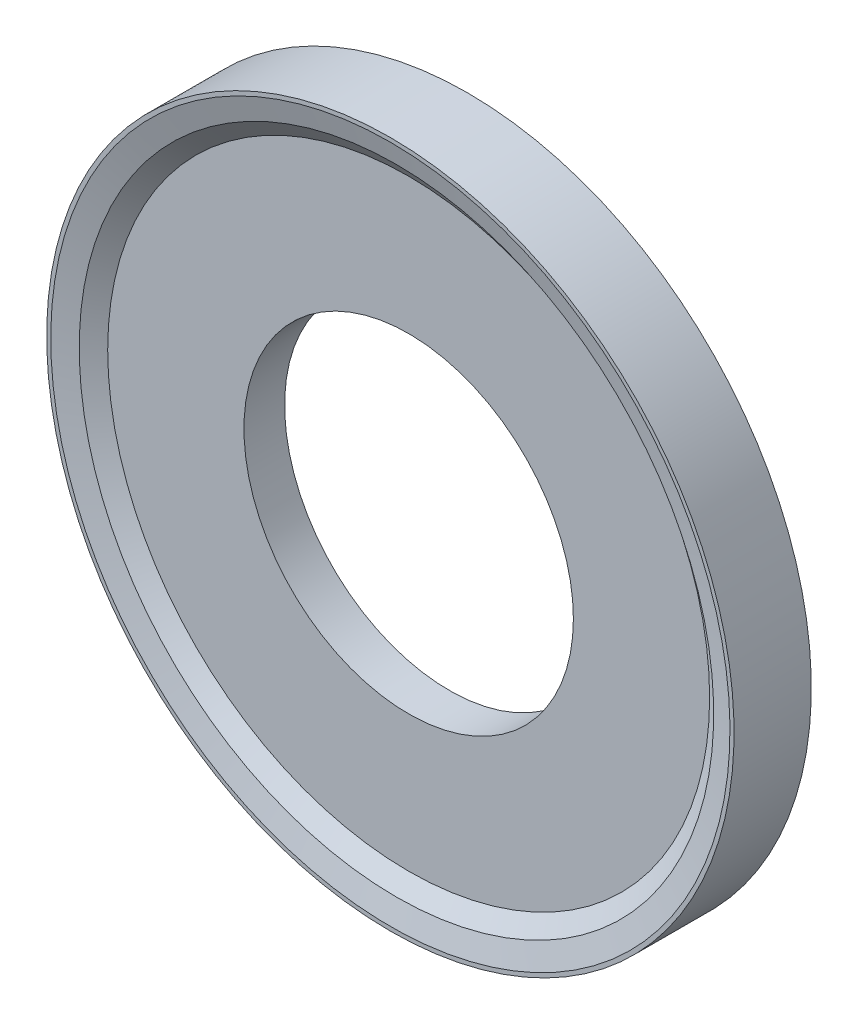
ISO-10303-21;
HEADER;
FILE_DESCRIPTION(('STEP AP214'),'2;1');
FILE_NAME('part.step','',(''),(''),'','','');
FILE_SCHEMA(('AUTOMOTIVE_DESIGN { 1 0 10303 214 1 1 1 1 }'));
ENDSEC;
DATA;
#1=APPLICATION_CONTEXT('core data for automotive mechanical design processes');
#2=APPLICATION_PROTOCOL_DEFINITION('international standard','automotive_design',2000,#1);
#3=PRODUCT_CONTEXT('',#1,'mechanical');
#4=PRODUCT('Part','Part','',(#3));
#5=PRODUCT_RELATED_PRODUCT_CATEGORY('part','',(#4));
#6=PRODUCT_DEFINITION_FORMATION('','',#4);
#7=PRODUCT_DEFINITION_CONTEXT('part definition',#1,'design');
#8=PRODUCT_DEFINITION('design','',#6,#7);
#9=PRODUCT_DEFINITION_SHAPE('','',#8);
#10=(LENGTH_UNIT() NAMED_UNIT(*) SI_UNIT(.MILLI.,.METRE.));
#11=(NAMED_UNIT(*) PLANE_ANGLE_UNIT() SI_UNIT($,.RADIAN.));
#12=(NAMED_UNIT(*) SI_UNIT($,.STERADIAN.) SOLID_ANGLE_UNIT());
#13=UNCERTAINTY_MEASURE_WITH_UNIT(LENGTH_MEASURE(1.E-05),#10,'distance_accuracy_value','');
#14=(GEOMETRIC_REPRESENTATION_CONTEXT(3) GLOBAL_UNCERTAINTY_ASSIGNED_CONTEXT((#13)) GLOBAL_UNIT_ASSIGNED_CONTEXT((#10,
#11,#12)) REPRESENTATION_CONTEXT('',''));
#15=CARTESIAN_POINT('',(0.,0.,0.));
#16=DIRECTION('',(0.,0.,1.));
#17=DIRECTION('',(1.,0.,0.));
#18=AXIS2_PLACEMENT_3D('',#15,#16,#17);
#19=CARTESIAN_POINT('',(7.4,0.,1.45));
#20=DIRECTION('',(0.,0.,1.));
#21=DIRECTION('',(0.,-1.,0.));
#22=AXIS2_PLACEMENT_3D('',#19,#20,#21);
#23=PLANE('',#22);
#24=CARTESIAN_POINT('',(0.,0.,1.45));
#25=DIRECTION('',(0.,0.,-1.));
#26=DIRECTION('',(0.,1.,0.));
#27=AXIS2_PLACEMENT_3D('',#24,#25,#26);
#28=CIRCLE('',#27,7.4);
#29=CARTESIAN_POINT('',(0.,7.4,1.45));
#30=VERTEX_POINT('',#29);
#31=EDGE_CURVE('E40',#30,#30,#28,.T.);
#32=ORIENTED_EDGE('',*,*,#31,.F.);
#33=EDGE_LOOP('',(#32));
#34=FACE_BOUND('',#33,.T.);
#35=CARTESIAN_POINT('',(0.,0.,1.45));
#36=DIRECTION('',(0.,0.,1.));
#37=DIRECTION('',(1.,0.,0.));
#38=AXIS2_PLACEMENT_3D('',#35,#36,#37);
#39=CIRCLE('',#38,4.05);
#40=CARTESIAN_POINT('',(4.05,0.,1.45));
#41=VERTEX_POINT('',#40);
#42=EDGE_CURVE('E44',#41,#41,#39,.T.);
#43=ORIENTED_EDGE('',*,*,#42,.F.);
#44=EDGE_LOOP('',(#43));
#45=FACE_BOUND('',#44,.T.);
#46=ADVANCED_FACE('F12',(#34,#45),#23,.T.);
#47=CARTESIAN_POINT('',(4.1,0.,0.45));
#48=DIRECTION('',(0.,0.,-1.));
#49=DIRECTION('',(0.,1.,0.));
#50=AXIS2_PLACEMENT_3D('',#47,#48,#49);
#51=PLANE('',#50);
#52=CARTESIAN_POINT('',(0.,0.,0.45));
#53=DIRECTION('',(0.,0.,-1.));
#54=DIRECTION('',(0.,1.,0.));
#55=AXIS2_PLACEMENT_3D('',#52,#53,#54);
#56=CIRCLE('',#55,7.4);
#57=CARTESIAN_POINT('',(0.,7.4,0.45));
#58=VERTEX_POINT('',#57);
#59=EDGE_CURVE('E8',#58,#58,#56,.T.);
#60=ORIENTED_EDGE('',*,*,#59,.T.);
#61=EDGE_LOOP('',(#60));
#62=FACE_BOUND('',#61,.T.);
#63=CARTESIAN_POINT('',(0.,0.,0.45));
#64=DIRECTION('',(0.,0.,1.));
#65=DIRECTION('',(1.,0.,0.));
#66=AXIS2_PLACEMENT_3D('',#63,#64,#65);
#67=CIRCLE('',#66,4.05);
#68=CARTESIAN_POINT('',(4.05,0.,0.45));
#69=VERTEX_POINT('',#68);
#70=EDGE_CURVE('E43',#69,#69,#67,.T.);
#71=ORIENTED_EDGE('',*,*,#70,.T.);
#72=EDGE_LOOP('',(#71));
#73=FACE_BOUND('',#72,.T.);
#74=ADVANCED_FACE('F50',(#62,#73),#51,.T.);
#75=CARTESIAN_POINT('',(0.,0.,0.45));
#76=DIRECTION('',(0.,0.,-1.));
#77=DIRECTION('',(0.,1.,0.));
#78=AXIS2_PLACEMENT_3D('',#75,#76,#77);
#79=CONICAL_SURFACE('',#78,7.4,0.927295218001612);
#80=CARTESIAN_POINT('',(0.,0.,0.15));
#81=DIRECTION('',(0.,0.,-1.));
#82=DIRECTION('',(0.,1.,0.));
#83=AXIS2_PLACEMENT_3D('',#80,#81,#82);
#84=CIRCLE('',#83,7.8);
#85=CARTESIAN_POINT('',(0.,7.8,0.15));
#86=VERTEX_POINT('',#85);
#87=EDGE_CURVE('E18',#86,#86,#84,.T.);
#88=ORIENTED_EDGE('',*,*,#87,.T.);
#89=EDGE_LOOP('',(#88));
#90=FACE_BOUND('',#89,.T.);
#91=ORIENTED_EDGE('',*,*,#59,.F.);
#92=EDGE_LOOP('',(#91));
#93=FACE_BOUND('',#92,.T.);
#94=ADVANCED_FACE('F65',(#90,#93),#79,.F.);
#95=CARTESIAN_POINT('',(0.,0.,0.15));
#96=DIRECTION('',(0.,0.,-1.));
#97=DIRECTION('',(0.,1.,0.));
#98=AXIS2_PLACEMENT_3D('',#95,#96,#97);
#99=CONICAL_SURFACE('',#98,7.8,1.30454427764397);
#100=CARTESIAN_POINT('',(0.,0.,0.));
#101=DIRECTION('',(0.,0.,-1.));
#102=DIRECTION('',(0.,1.,0.));
#103=AXIS2_PLACEMENT_3D('',#100,#101,#102);
#104=CIRCLE('',#103,8.35);
#105=CARTESIAN_POINT('',(0.,8.35,0.));
#106=VERTEX_POINT('',#105);
#107=EDGE_CURVE('E22',#106,#106,#104,.T.);
#108=ORIENTED_EDGE('',*,*,#107,.T.);
#109=EDGE_LOOP('',(#108));
#110=FACE_BOUND('',#109,.T.);
#111=ORIENTED_EDGE('',*,*,#87,.F.);
#112=EDGE_LOOP('',(#111));
#113=FACE_BOUND('',#112,.T.);
#114=ADVANCED_FACE('F94',(#110,#113),#99,.F.);
#115=CARTESIAN_POINT('',(8.35,0.,0.));
#116=DIRECTION('',(0.,0.,-1.));
#117=DIRECTION('',(0.,1.,0.));
#118=AXIS2_PLACEMENT_3D('',#115,#116,#117);
#119=PLANE('',#118);
#120=CARTESIAN_POINT('',(0.,0.,0.));
#121=DIRECTION('',(0.,0.,-1.));
#122=DIRECTION('',(0.,1.,0.));
#123=AXIS2_PLACEMENT_3D('',#120,#121,#122);
#124=CIRCLE('',#123,8.45);
#125=CARTESIAN_POINT('',(0.,8.45,0.));
#126=VERTEX_POINT('',#125);
#127=EDGE_CURVE('E26',#126,#126,#124,.T.);
#128=ORIENTED_EDGE('',*,*,#127,.T.);
#129=EDGE_LOOP('',(#128));
#130=FACE_BOUND('',#129,.T.);
#131=ORIENTED_EDGE('',*,*,#107,.F.);
#132=EDGE_LOOP('',(#131));
#133=FACE_BOUND('',#132,.T.);
#134=ADVANCED_FACE('F88',(#130,#133),#119,.T.);
#135=CARTESIAN_POINT('',(0.,0.,0.));
#136=DIRECTION('',(0.,0.,-1.));
#137=DIRECTION('',(0.,1.,0.));
#138=AXIS2_PLACEMENT_3D('',#135,#136,#137);
#139=CYLINDRICAL_SURFACE('',#138,8.45);
#140=CARTESIAN_POINT('',(0.,0.,1.9));
#141=DIRECTION('',(0.,0.,-1.));
#142=DIRECTION('',(0.,1.,0.));
#143=AXIS2_PLACEMENT_3D('',#140,#141,#142);
#144=CIRCLE('',#143,8.45);
#145=CARTESIAN_POINT('',(0.,8.45,1.9));
#146=VERTEX_POINT('',#145);
#147=EDGE_CURVE('E31',#146,#146,#144,.T.);
#148=ORIENTED_EDGE('',*,*,#147,.T.);
#149=EDGE_LOOP('',(#148));
#150=FACE_BOUND('',#149,.T.);
#151=ORIENTED_EDGE('',*,*,#127,.F.);
#152=EDGE_LOOP('',(#151));
#153=FACE_BOUND('',#152,.T.);
#154=ADVANCED_FACE('F82',(#150,#153),#139,.T.);
#155=CARTESIAN_POINT('',(8.45,0.,1.9));
#156=DIRECTION('',(0.,0.,1.));
#157=DIRECTION('',(0.,-1.,0.));
#158=AXIS2_PLACEMENT_3D('',#155,#156,#157);
#159=PLANE('',#158);
#160=CARTESIAN_POINT('',(0.,0.,1.9));
#161=DIRECTION('',(0.,0.,-1.));
#162=DIRECTION('',(0.,1.,0.));
#163=AXIS2_PLACEMENT_3D('',#160,#161,#162);
#164=CIRCLE('',#163,8.35);
#165=CARTESIAN_POINT('',(0.,8.35,1.9));
#166=VERTEX_POINT('',#165);
#167=EDGE_CURVE('E34',#166,#166,#164,.T.);
#168=ORIENTED_EDGE('',*,*,#167,.T.);
#169=EDGE_LOOP('',(#168));
#170=FACE_BOUND('',#169,.T.);
#171=ORIENTED_EDGE('',*,*,#147,.F.);
#172=EDGE_LOOP('',(#171));
#173=FACE_BOUND('',#172,.T.);
#174=ADVANCED_FACE('F76',(#170,#173),#159,.T.);
#175=CARTESIAN_POINT('',(0.,0.,1.9));
#176=DIRECTION('',(0.,0.,1.));
#177=DIRECTION('',(0.,-1.,0.));
#178=AXIS2_PLACEMENT_3D('',#175,#176,#177);
#179=CONICAL_SURFACE('',#178,8.35,1.30454427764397);
#180=CARTESIAN_POINT('',(0.,0.,1.75));
#181=DIRECTION('',(0.,0.,-1.));
#182=DIRECTION('',(0.,1.,0.));
#183=AXIS2_PLACEMENT_3D('',#180,#181,#182);
#184=CIRCLE('',#183,7.8);
#185=CARTESIAN_POINT('',(0.,7.8,1.75));
#186=VERTEX_POINT('',#185);
#187=EDGE_CURVE('E37',#186,#186,#184,.T.);
#188=ORIENTED_EDGE('',*,*,#187,.T.);
#189=EDGE_LOOP('',(#188));
#190=FACE_BOUND('',#189,.T.);
#191=ORIENTED_EDGE('',*,*,#167,.F.);
#192=EDGE_LOOP('',(#191));
#193=FACE_BOUND('',#192,.T.);
#194=ADVANCED_FACE('F70',(#190,#193),#179,.F.);
#195=CARTESIAN_POINT('',(0.,0.,1.75));
#196=DIRECTION('',(0.,0.,1.));
#197=DIRECTION('',(0.,-1.,0.));
#198=AXIS2_PLACEMENT_3D('',#195,#196,#197);
#199=CONICAL_SURFACE('',#198,7.8,0.927295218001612);
#200=ORIENTED_EDGE('',*,*,#31,.T.);
#201=EDGE_LOOP('',(#200));
#202=FACE_BOUND('',#201,.T.);
#203=ORIENTED_EDGE('',*,*,#187,.F.);
#204=EDGE_LOOP('',(#203));
#205=FACE_BOUND('',#204,.T.);
#206=ADVANCED_FACE('F55',(#202,#205),#199,.F.);
#207=CARTESIAN_POINT('',(0.,0.,0.45));
#208=DIRECTION('',(0.,0.,1.));
#209=DIRECTION('',(1.,0.,0.));
#210=AXIS2_PLACEMENT_3D('',#207,#208,#209);
#211=CYLINDRICAL_SURFACE('',#210,4.05);
#212=ORIENTED_EDGE('',*,*,#70,.F.);
#213=EDGE_LOOP('',(#212));
#214=FACE_BOUND('',#213,.T.);
#215=ORIENTED_EDGE('',*,*,#42,.T.);
#216=EDGE_LOOP('',(#215));
#217=FACE_BOUND('',#216,.T.);
#218=ADVANCED_FACE('F52',(#214,#217),#211,.F.);
#219=CLOSED_SHELL('',(#46,#74,#94,#114,#134,#154,#174,#194,#206,#218));
#220=MANIFOLD_SOLID_BREP('B1',#219);
#221=ADVANCED_BREP_SHAPE_REPRESENTATION('',(#18,#220),#14);
#222=SHAPE_DEFINITION_REPRESENTATION(#9,#221);
ENDSEC;
END-ISO-10303-21;
